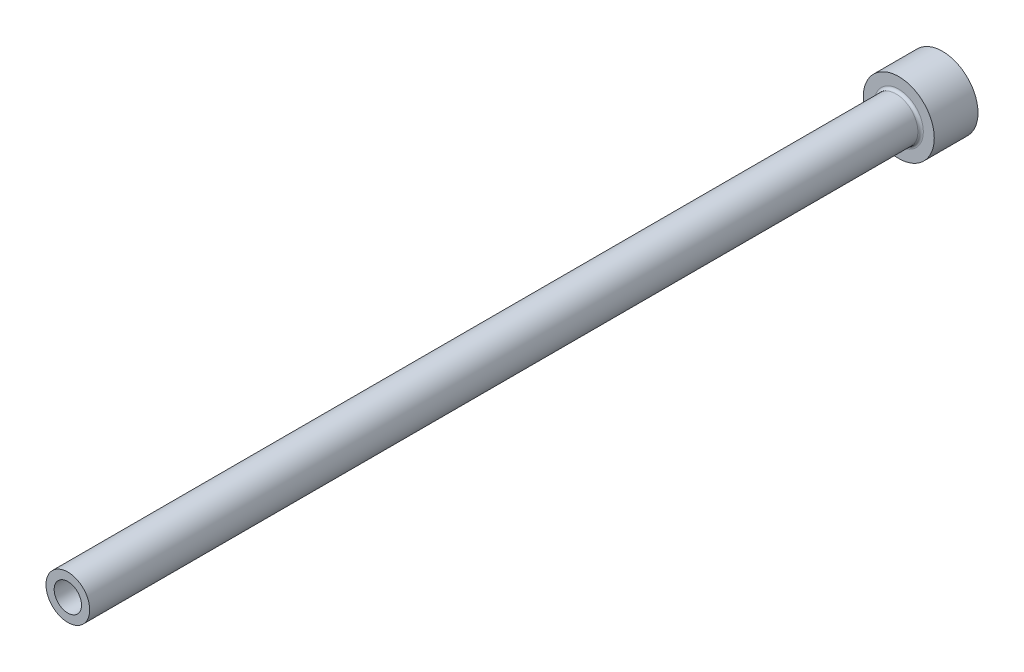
from build123d import *

# Parameters (mm, degrees)
HEAD_FILLET_R          = 0.5
ID_RELIEF_CHAMFER_SIZE = 0.5


with BuildPart() as part:
    # OD FV → Base Revolve (revolve)
    with BuildSketch(Plane(origin=(0, 0, 0), x_dir=(1, 0, 0), z_dir=(0, 1, 0))):
        Polygon((0, -160), (4, -160), (4, -8), (6.5, -8), (6.5, 0), (0, 0), align=None)
    revolve(axis=Axis((0, 0, 160), (0, 0, -1)))

    # ID FV → Hole (revolve, cut)
    with BuildSketch(Plane(origin=(0, 0, 0), x_dir=(1, 0, 0), z_dir=(0, 1, 0))):
        Polygon((0, -160), (2.5, -160), (2.5, -85), (2.75, -84.566987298), (2.75, 0), (0, 0), align=None)
    revolve(axis=Axis((0, 0, 160), (0, 0, -1)), mode=Mode.SUBTRACT)

    # Head Fillet
    head_fillet_edges = [part.edges().sort_by_distance(p)[0] for p in [
        (-4, 0, 8),
    ]]
    fillet(head_fillet_edges, radius=HEAD_FILLET_R)

    # ID Relief Chamfer
    id_relief_chamfer_edges = [part.edges().sort_by_distance(p)[0] for p in [
        (-2.75, 0, 0),
    ]]
    chamfer(id_relief_chamfer_edges, length=ID_RELIEF_CHAMFER_SIZE)


solid = part.part
